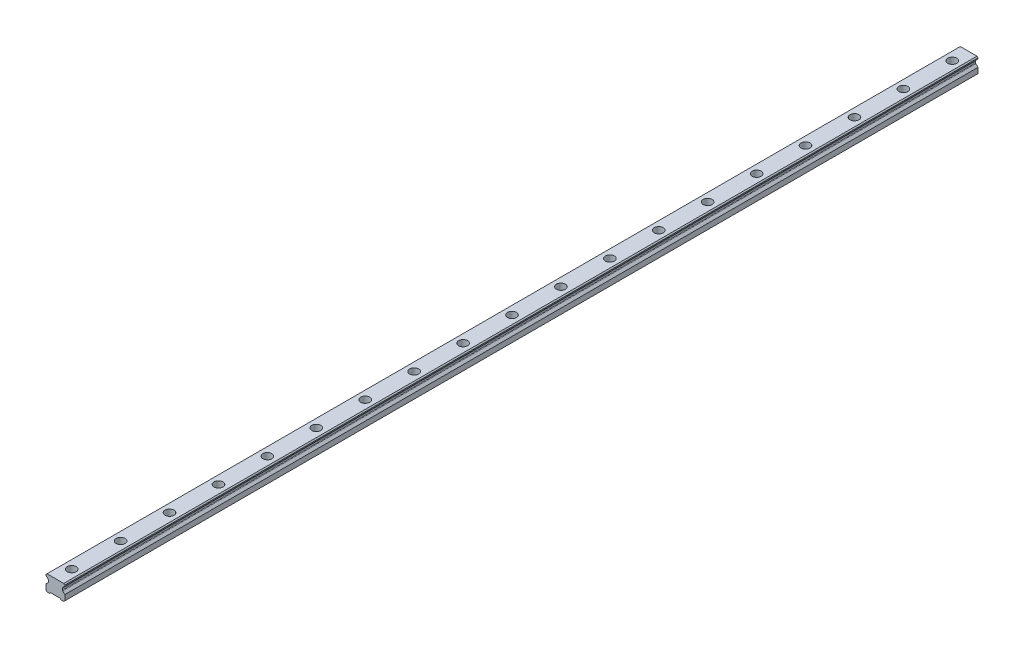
from build123d import *

# Parameters (mm, degrees)
SKETCH1_W           = 23
SKETCH1_H           = 19.2
BOSS_EXTRUDE1_DEPTH = 560
CUT_EXTRUDE1_DEPTH  = 1121.223589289
CHAMFER1_SIZE       = 1.25
FILLET1_R           = 1.25
CUT_EXTRUDE2_DEPTH  = 1121.223589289
SKETCH4_R           = 5.5
SKETCH4_R_2         = 3.5
CUT_EXTRUDE3_DEPTH  = 9
SKETCH4_2_R         = 3.5
CUT_EXTRUDE4_DEPTH  = 561.447044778
LPATTERN1_COUNT     = 19
LPATTERN1_PITCH     = 60


with BuildPart() as part:
    # Sketch1 → Boss-Extrude1 (new, symmetric)
    with BuildSketch(Plane.XY):
        with Locations((0, 9.6)):
            Rectangle(SKETCH1_W, SKETCH1_H)
    extrude(amount=BOSS_EXTRUDE1_DEPTH, both=True)

    # Sketch2 → Cut-Extrude1 (cut, through all)
    with BuildSketch(Plane.XY.offset(560)):
        Polygon((-11.5, 16.7), (-11.5, 7.95), (-8.583333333, 10.866666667), (-8.583333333, 13.783333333), align=None)
        Polygon((8.583333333, 13.783333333), (11.5, 16.7), (11.5, 7.95), (8.583333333, 10.866666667), align=None)
    extrude(amount=-CUT_EXTRUDE1_DEPTH, mode=Mode.SUBTRACT)

    # Chamfer1
    chamfer1_edges = [part.edges().sort_by_distance(p)[0] for p in [
        (-11.5, 19.2, 0),
        (11.5, 19.2, 0),
        (11.5, 0, 0),
        (-11.5, 0, 0),
    ]]
    chamfer(chamfer1_edges, length=CHAMFER1_SIZE)

    # Fillet1
    fillet1_edges = [part.edges().sort_by_distance(p)[0] for p in [
        (-8.583333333, 13.783333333, 0),
        (-8.583333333, 10.866666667, 0),
        (8.583333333, 10.866666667, 0),
        (8.583333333, 13.783333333, 0),
    ]]
    fillet(fillet1_edges, radius=FILLET1_R)

    # Sketch3 → Cut-Extrude2 (cut, through all)
    with BuildSketch(Plane.XY.offset(560)):
        Polygon((-7, 0), (-5.75, 1.25), (5.75, 1.25), (7, 0), align=None)
    extrude(amount=-CUT_EXTRUDE2_DEPTH, mode=Mode.SUBTRACT)

    # Sketch4 → Cut-Extrude3 (cut)
    with BuildSketch(Plane(origin=(0, 19.2, 0), x_dir=(1, 0, 0), z_dir=(0, 1, 0))):
        with Locations(Location((0, -540, 0), (0, 0, 270))):
            Circle(SKETCH4_R)
        with Locations(Location((0, -540, 0), (0, 0, 270))):
            Circle(SKETCH4_R_2, mode=Mode.SUBTRACT)
    cut_extrude3 = extrude(amount=-CUT_EXTRUDE3_DEPTH, mode=Mode.SUBTRACT)

    # Sketch4_2 → Cut-Extrude4 (cut, through all)
    with BuildSketch(Plane(origin=(0, 19.2, 0), x_dir=(1, 0, 0), z_dir=(0, 1, 0))):
        with Locations(Location((0, -540, 0), (0, 0, 270))):
            Circle(SKETCH4_2_R)
    cut_extrude4 = extrude(amount=-CUT_EXTRUDE4_DEPTH, mode=Mode.SUBTRACT)

    # LPattern1: Cut-Extrude3, Cut-Extrude4 ×19
    with Locations(*[(0, 0, -i * LPATTERN1_PITCH) for i in range(1, LPATTERN1_COUNT)]):
        add(cut_extrude3, mode=Mode.SUBTRACT)
        add(cut_extrude4, mode=Mode.SUBTRACT)


solid = part.part
